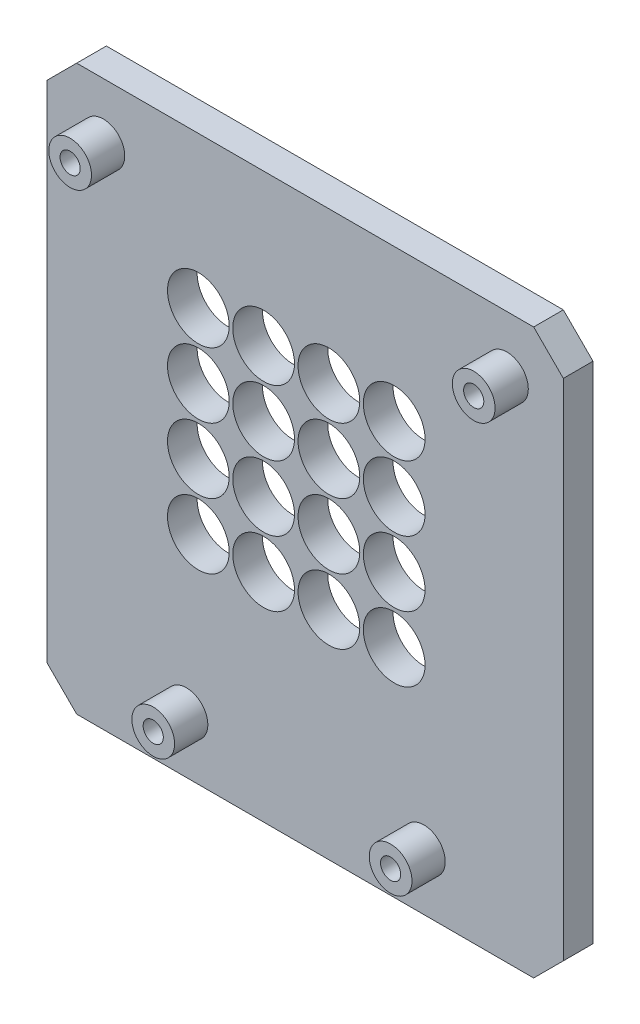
ISO-10303-21;
HEADER;
FILE_DESCRIPTION(('STEP AP214'),'2;1');
FILE_NAME('part.step','',(''),(''),'','','');
FILE_SCHEMA(('AUTOMOTIVE_DESIGN { 1 0 10303 214 1 1 1 1 }'));
ENDSEC;
DATA;
#1=APPLICATION_CONTEXT('core data for automotive mechanical design processes');
#2=APPLICATION_PROTOCOL_DEFINITION('international standard','automotive_design',2000,#1);
#3=PRODUCT_CONTEXT('',#1,'mechanical');
#4=PRODUCT('Part','Part','',(#3));
#5=PRODUCT_RELATED_PRODUCT_CATEGORY('part','',(#4));
#6=PRODUCT_DEFINITION_FORMATION('','',#4);
#7=PRODUCT_DEFINITION_CONTEXT('part definition',#1,'design');
#8=PRODUCT_DEFINITION('design','',#6,#7);
#9=PRODUCT_DEFINITION_SHAPE('','',#8);
#10=(LENGTH_UNIT() NAMED_UNIT(*) SI_UNIT(.MILLI.,.METRE.));
#11=(NAMED_UNIT(*) PLANE_ANGLE_UNIT() SI_UNIT($,.RADIAN.));
#12=(NAMED_UNIT(*) SI_UNIT($,.STERADIAN.) SOLID_ANGLE_UNIT());
#13=UNCERTAINTY_MEASURE_WITH_UNIT(LENGTH_MEASURE(1.E-05),#10,'distance_accuracy_value','');
#14=(GEOMETRIC_REPRESENTATION_CONTEXT(3) GLOBAL_UNCERTAINTY_ASSIGNED_CONTEXT((#13)) GLOBAL_UNIT_ASSIGNED_CONTEXT((#10,
#11,#12)) REPRESENTATION_CONTEXT('',''));
#15=CARTESIAN_POINT('',(0.,0.,0.));
#16=DIRECTION('',(0.,0.,1.));
#17=DIRECTION('',(1.,0.,0.));
#18=AXIS2_PLACEMENT_3D('',#15,#16,#17);
#19=CARTESIAN_POINT('',(0.,0.,5.));
#20=DIRECTION('',(0.,0.,1.));
#21=DIRECTION('',(1.,0.,0.));
#22=AXIS2_PLACEMENT_3D('',#19,#20,#21);
#23=PLANE('',#22);
#24=CARTESIAN_POINT('',(21.5,-43.5,5.));
#25=DIRECTION('',(0.,0.,1.));
#26=DIRECTION('',(1.,0.,0.));
#27=AXIS2_PLACEMENT_3D('',#24,#25,#26);
#28=CIRCLE('',#27,3.6);
#29=CARTESIAN_POINT('',(25.1,-43.5,5.));
#30=VERTEX_POINT('',#29);
#31=EDGE_CURVE('E319',#30,#30,#28,.T.);
#32=ORIENTED_EDGE('',*,*,#31,.F.);
#33=EDGE_LOOP('',(#32));
#34=FACE_BOUND('',#33,.T.);
#35=CARTESIAN_POINT('',(35.5,32.5,5.));
#36=DIRECTION('',(0.,0.,1.));
#37=DIRECTION('',(1.,0.,0.));
#38=AXIS2_PLACEMENT_3D('',#35,#36,#37);
#39=CIRCLE('',#38,3.6);
#40=CARTESIAN_POINT('',(39.1,32.5,5.));
#41=VERTEX_POINT('',#40);
#42=EDGE_CURVE('E312',#41,#41,#39,.T.);
#43=ORIENTED_EDGE('',*,*,#42,.F.);
#44=EDGE_LOOP('',(#43));
#45=FACE_BOUND('',#44,.T.);
#46=CARTESIAN_POINT('',(5.5,16.5,5.));
#47=DIRECTION('',(0.,0.,1.));
#48=DIRECTION('',(1.,0.,0.));
#49=AXIS2_PLACEMENT_3D('',#46,#47,#48);
#50=CIRCLE('',#49,5.2);
#51=CARTESIAN_POINT('',(10.7,16.5,5.));
#52=VERTEX_POINT('',#51);
#53=EDGE_CURVE('E270',#52,#52,#50,.T.);
#54=ORIENTED_EDGE('',*,*,#53,.F.);
#55=EDGE_LOOP('',(#54));
#56=FACE_BOUND('',#55,.T.);
#57=CARTESIAN_POINT('',(-16.5,16.5,5.));
#58=DIRECTION('',(0.,0.,1.));
#59=DIRECTION('',(1.,0.,0.));
#60=AXIS2_PLACEMENT_3D('',#57,#58,#59);
#61=CIRCLE('',#60,5.2);
#62=CARTESIAN_POINT('',(-11.3,16.5,5.));
#63=VERTEX_POINT('',#62);
#64=EDGE_CURVE('E258',#63,#63,#61,.T.);
#65=ORIENTED_EDGE('',*,*,#64,.F.);
#66=EDGE_LOOP('',(#65));
#67=FACE_BOUND('',#66,.T.);
#68=CARTESIAN_POINT('',(5.5,5.5,5.));
#69=DIRECTION('',(0.,0.,1.));
#70=DIRECTION('',(1.,0.,0.));
#71=AXIS2_PLACEMENT_3D('',#68,#69,#70);
#72=CIRCLE('',#71,5.2);
#73=CARTESIAN_POINT('',(10.7,5.5,5.));
#74=VERTEX_POINT('',#73);
#75=EDGE_CURVE('E246',#74,#74,#72,.T.);
#76=ORIENTED_EDGE('',*,*,#75,.F.);
#77=EDGE_LOOP('',(#76));
#78=FACE_BOUND('',#77,.T.);
#79=CARTESIAN_POINT('',(-16.5,5.5,5.));
#80=DIRECTION('',(0.,0.,1.));
#81=DIRECTION('',(1.,0.,0.));
#82=AXIS2_PLACEMENT_3D('',#79,#80,#81);
#83=CIRCLE('',#82,5.2);
#84=CARTESIAN_POINT('',(-11.3,5.5,5.));
#85=VERTEX_POINT('',#84);
#86=EDGE_CURVE('E234',#85,#85,#83,.T.);
#87=ORIENTED_EDGE('',*,*,#86,.F.);
#88=EDGE_LOOP('',(#87));
#89=FACE_BOUND('',#88,.T.);
#90=CARTESIAN_POINT('',(5.5,-5.5,5.));
#91=DIRECTION('',(0.,0.,1.));
#92=DIRECTION('',(1.,0.,0.));
#93=AXIS2_PLACEMENT_3D('',#90,#91,#92);
#94=CIRCLE('',#93,5.2);
#95=CARTESIAN_POINT('',(10.7,-5.5,5.));
#96=VERTEX_POINT('',#95);
#97=EDGE_CURVE('E222',#96,#96,#94,.T.);
#98=ORIENTED_EDGE('',*,*,#97,.F.);
#99=EDGE_LOOP('',(#98));
#100=FACE_BOUND('',#99,.T.);
#101=CARTESIAN_POINT('',(-16.5,-5.5,5.));
#102=DIRECTION('',(0.,0.,1.));
#103=DIRECTION('',(1.,0.,0.));
#104=AXIS2_PLACEMENT_3D('',#101,#102,#103);
#105=CIRCLE('',#104,5.2);
#106=CARTESIAN_POINT('',(-11.3,-5.5,5.));
#107=VERTEX_POINT('',#106);
#108=EDGE_CURVE('E210',#107,#107,#105,.T.);
#109=ORIENTED_EDGE('',*,*,#108,.F.);
#110=EDGE_LOOP('',(#109));
#111=FACE_BOUND('',#110,.T.);
#112=CARTESIAN_POINT('',(5.5,-16.5,5.));
#113=DIRECTION('',(0.,0.,1.));
#114=DIRECTION('',(1.,0.,0.));
#115=AXIS2_PLACEMENT_3D('',#112,#113,#114);
#116=CIRCLE('',#115,5.2);
#117=CARTESIAN_POINT('',(10.7,-16.5,5.));
#118=VERTEX_POINT('',#117);
#119=EDGE_CURVE('E198',#118,#118,#116,.T.);
#120=ORIENTED_EDGE('',*,*,#119,.F.);
#121=EDGE_LOOP('',(#120));
#122=FACE_BOUND('',#121,.T.);
#123=CARTESIAN_POINT('',(-16.5,-16.5,5.));
#124=DIRECTION('',(0.,0.,1.));
#125=DIRECTION('',(1.,0.,0.));
#126=AXIS2_PLACEMENT_3D('',#123,#124,#125);
#127=CIRCLE('',#126,5.2);
#128=CARTESIAN_POINT('',(-11.3,-16.5,5.));
#129=VERTEX_POINT('',#128);
#130=EDGE_CURVE('E144',#129,#129,#127,.T.);
#131=ORIENTED_EDGE('',*,*,#130,.F.);
#132=EDGE_LOOP('',(#131));
#133=FACE_BOUND('',#132,.T.);
#134=DIRECTION('',(0.707106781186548,-0.707106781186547,0.));
#135=VECTOR('',#134,1.);
#136=CARTESIAN_POINT('',(-42.,-48.,5.));
#137=LINE('',#136,#135);
#138=CARTESIAN_POINT('',(-42.,-48.,5.));
#139=VERTEX_POINT('',#138);
#140=CARTESIAN_POINT('',(-37.,-53.,5.));
#141=VERTEX_POINT('',#140);
#142=EDGE_CURVE('E155',#139,#141,#137,.T.);
#143=ORIENTED_EDGE('',*,*,#142,.T.);
#144=DIRECTION('',(1.,0.,0.));
#145=VECTOR('',#144,1.);
#146=CARTESIAN_POINT('',(-37.,-53.,5.));
#147=LINE('',#146,#145);
#148=CARTESIAN_POINT('',(40.,-53.,5.));
#149=VERTEX_POINT('',#148);
#150=EDGE_CURVE('E103',#141,#149,#147,.T.);
#151=ORIENTED_EDGE('',*,*,#150,.T.);
#152=DIRECTION('',(0.707106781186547,0.707106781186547,0.));
#153=VECTOR('',#152,1.);
#154=CARTESIAN_POINT('',(40.,-53.,5.));
#155=LINE('',#154,#153);
#156=CARTESIAN_POINT('',(45.,-48.,5.));
#157=VERTEX_POINT('',#156);
#158=EDGE_CURVE('E170',#149,#157,#155,.T.);
#159=ORIENTED_EDGE('',*,*,#158,.T.);
#160=DIRECTION('',(0.,1.,0.));
#161=VECTOR('',#160,1.);
#162=CARTESIAN_POINT('',(45.,-48.,5.));
#163=LINE('',#162,#161);
#164=CARTESIAN_POINT('',(45.,37.,5.));
#165=VERTEX_POINT('',#164);
#166=EDGE_CURVE('E183',#157,#165,#163,.T.);
#167=ORIENTED_EDGE('',*,*,#166,.T.);
#168=DIRECTION('',(-0.707106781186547,0.707106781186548,0.));
#169=VECTOR('',#168,1.);
#170=CARTESIAN_POINT('',(45.,37.,5.));
#171=LINE('',#170,#169);
#172=CARTESIAN_POINT('',(40.,42.,5.));
#173=VERTEX_POINT('',#172);
#174=EDGE_CURVE('E122',#165,#173,#171,.T.);
#175=ORIENTED_EDGE('',*,*,#174,.T.);
#176=DIRECTION('',(-1.,0.,0.));
#177=VECTOR('',#176,1.);
#178=CARTESIAN_POINT('',(40.,42.,5.));
#179=LINE('',#178,#177);
#180=CARTESIAN_POINT('',(-37.,42.,5.));
#181=VERTEX_POINT('',#180);
#182=EDGE_CURVE('E116',#173,#181,#179,.T.);
#183=ORIENTED_EDGE('',*,*,#182,.T.);
#184=DIRECTION('',(-0.707106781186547,-0.707106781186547,0.));
#185=VECTOR('',#184,1.);
#186=CARTESIAN_POINT('',(-37.,42.,5.));
#187=LINE('',#186,#185);
#188=CARTESIAN_POINT('',(-42.,37.,5.));
#189=VERTEX_POINT('',#188);
#190=EDGE_CURVE('E120',#181,#189,#187,.T.);
#191=ORIENTED_EDGE('',*,*,#190,.T.);
#192=DIRECTION('',(0.,-1.,0.));
#193=VECTOR('',#192,1.);
#194=CARTESIAN_POINT('',(-42.,37.,5.));
#195=LINE('',#194,#193);
#196=EDGE_CURVE('E60',#189,#139,#195,.T.);
#197=ORIENTED_EDGE('',*,*,#196,.T.);
#198=EDGE_LOOP('',(#143,#151,#159,#167,#175,#183,#191,#197));
#199=FACE_BOUND('',#198,.T.);
#200=CARTESIAN_POINT('',(-5.5,-16.5,5.));
#201=DIRECTION('',(0.,0.,1.));
#202=DIRECTION('',(1.,0.,0.));
#203=AXIS2_PLACEMENT_3D('',#200,#201,#202);
#204=CIRCLE('',#203,5.2);
#205=CARTESIAN_POINT('',(-0.3,-16.5,5.));
#206=VERTEX_POINT('',#205);
#207=EDGE_CURVE('E192',#206,#206,#204,.T.);
#208=ORIENTED_EDGE('',*,*,#207,.F.);
#209=EDGE_LOOP('',(#208));
#210=FACE_BOUND('',#209,.T.);
#211=CARTESIAN_POINT('',(16.5,-16.5,5.));
#212=DIRECTION('',(0.,0.,1.));
#213=DIRECTION('',(1.,0.,0.));
#214=AXIS2_PLACEMENT_3D('',#211,#212,#213);
#215=CIRCLE('',#214,5.2);
#216=CARTESIAN_POINT('',(21.7,-16.5,5.));
#217=VERTEX_POINT('',#216);
#218=EDGE_CURVE('E204',#217,#217,#215,.T.);
#219=ORIENTED_EDGE('',*,*,#218,.F.);
#220=EDGE_LOOP('',(#219));
#221=FACE_BOUND('',#220,.T.);
#222=CARTESIAN_POINT('',(-5.5,-5.5,5.));
#223=DIRECTION('',(0.,0.,1.));
#224=DIRECTION('',(1.,0.,0.));
#225=AXIS2_PLACEMENT_3D('',#222,#223,#224);
#226=CIRCLE('',#225,5.2);
#227=CARTESIAN_POINT('',(-0.3,-5.5,5.));
#228=VERTEX_POINT('',#227);
#229=EDGE_CURVE('E216',#228,#228,#226,.T.);
#230=ORIENTED_EDGE('',*,*,#229,.F.);
#231=EDGE_LOOP('',(#230));
#232=FACE_BOUND('',#231,.T.);
#233=CARTESIAN_POINT('',(16.5,-5.5,5.));
#234=DIRECTION('',(0.,0.,1.));
#235=DIRECTION('',(1.,0.,0.));
#236=AXIS2_PLACEMENT_3D('',#233,#234,#235);
#237=CIRCLE('',#236,5.2);
#238=CARTESIAN_POINT('',(21.7,-5.5,5.));
#239=VERTEX_POINT('',#238);
#240=EDGE_CURVE('E228',#239,#239,#237,.T.);
#241=ORIENTED_EDGE('',*,*,#240,.F.);
#242=EDGE_LOOP('',(#241));
#243=FACE_BOUND('',#242,.T.);
#244=CARTESIAN_POINT('',(-5.5,5.5,5.));
#245=DIRECTION('',(0.,0.,1.));
#246=DIRECTION('',(1.,0.,0.));
#247=AXIS2_PLACEMENT_3D('',#244,#245,#246);
#248=CIRCLE('',#247,5.2);
#249=CARTESIAN_POINT('',(-0.3,5.5,5.));
#250=VERTEX_POINT('',#249);
#251=EDGE_CURVE('E240',#250,#250,#248,.T.);
#252=ORIENTED_EDGE('',*,*,#251,.F.);
#253=EDGE_LOOP('',(#252));
#254=FACE_BOUND('',#253,.T.);
#255=CARTESIAN_POINT('',(16.5,5.5,5.));
#256=DIRECTION('',(0.,0.,1.));
#257=DIRECTION('',(1.,0.,0.));
#258=AXIS2_PLACEMENT_3D('',#255,#256,#257);
#259=CIRCLE('',#258,5.2);
#260=CARTESIAN_POINT('',(21.7,5.5,5.));
#261=VERTEX_POINT('',#260);
#262=EDGE_CURVE('E252',#261,#261,#259,.T.);
#263=ORIENTED_EDGE('',*,*,#262,.F.);
#264=EDGE_LOOP('',(#263));
#265=FACE_BOUND('',#264,.T.);
#266=CARTESIAN_POINT('',(-5.5,16.5,5.));
#267=DIRECTION('',(0.,0.,1.));
#268=DIRECTION('',(1.,0.,0.));
#269=AXIS2_PLACEMENT_3D('',#266,#267,#268);
#270=CIRCLE('',#269,5.2);
#271=CARTESIAN_POINT('',(-0.3,16.5,5.));
#272=VERTEX_POINT('',#271);
#273=EDGE_CURVE('E264',#272,#272,#270,.T.);
#274=ORIENTED_EDGE('',*,*,#273,.F.);
#275=EDGE_LOOP('',(#274));
#276=FACE_BOUND('',#275,.T.);
#277=CARTESIAN_POINT('',(16.5,16.5,5.));
#278=DIRECTION('',(0.,0.,1.));
#279=DIRECTION('',(1.,0.,0.));
#280=AXIS2_PLACEMENT_3D('',#277,#278,#279);
#281=CIRCLE('',#280,5.2);
#282=CARTESIAN_POINT('',(21.7,16.5,5.));
#283=VERTEX_POINT('',#282);
#284=EDGE_CURVE('E276',#283,#283,#281,.T.);
#285=ORIENTED_EDGE('',*,*,#284,.F.);
#286=EDGE_LOOP('',(#285));
#287=FACE_BOUND('',#286,.T.);
#288=CARTESIAN_POINT('',(-18.5,-43.5,5.));
#289=DIRECTION('',(0.,0.,1.));
#290=DIRECTION('',(1.,0.,0.));
#291=AXIS2_PLACEMENT_3D('',#288,#289,#290);
#292=CIRCLE('',#291,3.6);
#293=CARTESIAN_POINT('',(-14.9,-43.5,5.));
#294=VERTEX_POINT('',#293);
#295=EDGE_CURVE('E301',#294,#294,#292,.T.);
#296=ORIENTED_EDGE('',*,*,#295,.F.);
#297=EDGE_LOOP('',(#296));
#298=FACE_BOUND('',#297,.T.);
#299=CARTESIAN_POINT('',(-32.5,32.5,5.));
#300=DIRECTION('',(0.,0.,1.));
#301=DIRECTION('',(1.,0.,0.));
#302=AXIS2_PLACEMENT_3D('',#299,#300,#301);
#303=CIRCLE('',#302,3.6);
#304=CARTESIAN_POINT('',(-28.9,32.5,5.));
#305=VERTEX_POINT('',#304);
#306=EDGE_CURVE('E325',#305,#305,#303,.T.);
#307=ORIENTED_EDGE('',*,*,#306,.F.);
#308=EDGE_LOOP('',(#307));
#309=FACE_BOUND('',#308,.T.);
#310=ADVANCED_FACE('F43',(#34,#45,#56,#67,#78,#89,#100,#111,#122,#133,#199,#210,#221,#232,#243,
#254,#265,#276,#287,#298,#309),#23,.T.);
#311=CARTESIAN_POINT('',(0.,0.,0.));
#312=DIRECTION('',(0.,0.,1.));
#313=DIRECTION('',(1.,0.,0.));
#314=AXIS2_PLACEMENT_3D('',#311,#312,#313);
#315=PLANE('',#314);
#316=DIRECTION('',(0.707106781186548,-0.707106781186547,0.));
#317=VECTOR('',#316,1.);
#318=CARTESIAN_POINT('',(-42.,-48.,0.));
#319=LINE('',#318,#317);
#320=CARTESIAN_POINT('',(-42.,-48.,0.));
#321=VERTEX_POINT('',#320);
#322=CARTESIAN_POINT('',(-37.,-53.,0.));
#323=VERTEX_POINT('',#322);
#324=EDGE_CURVE('E140',#321,#323,#319,.T.);
#325=ORIENTED_EDGE('',*,*,#324,.F.);
#326=DIRECTION('',(0.,-1.,0.));
#327=VECTOR('',#326,1.);
#328=CARTESIAN_POINT('',(-42.,37.,0.));
#329=LINE('',#328,#327);
#330=CARTESIAN_POINT('',(-42.,37.,0.));
#331=VERTEX_POINT('',#330);
#332=EDGE_CURVE('E95',#331,#321,#329,.T.);
#333=ORIENTED_EDGE('',*,*,#332,.F.);
#334=DIRECTION('',(-0.707106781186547,-0.707106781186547,0.));
#335=VECTOR('',#334,1.);
#336=CARTESIAN_POINT('',(-37.,42.,0.));
#337=LINE('',#336,#335);
#338=CARTESIAN_POINT('',(-37.,42.,0.));
#339=VERTEX_POINT('',#338);
#340=EDGE_CURVE('E89',#339,#331,#337,.T.);
#341=ORIENTED_EDGE('',*,*,#340,.F.);
#342=DIRECTION('',(-1.,0.,0.));
#343=VECTOR('',#342,1.);
#344=CARTESIAN_POINT('',(40.,42.,0.));
#345=LINE('',#344,#343);
#346=CARTESIAN_POINT('',(40.,42.,0.));
#347=VERTEX_POINT('',#346);
#348=EDGE_CURVE('E130',#347,#339,#345,.T.);
#349=ORIENTED_EDGE('',*,*,#348,.F.);
#350=DIRECTION('',(-0.707106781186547,0.707106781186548,0.));
#351=VECTOR('',#350,1.);
#352=CARTESIAN_POINT('',(45.,37.,0.));
#353=LINE('',#352,#351);
#354=CARTESIAN_POINT('',(45.,37.,0.));
#355=VERTEX_POINT('',#354);
#356=EDGE_CURVE('E150',#355,#347,#353,.T.);
#357=ORIENTED_EDGE('',*,*,#356,.F.);
#358=DIRECTION('',(0.,1.,0.));
#359=VECTOR('',#358,1.);
#360=CARTESIAN_POINT('',(45.,-48.,0.));
#361=LINE('',#360,#359);
#362=CARTESIAN_POINT('',(45.,-48.,0.));
#363=VERTEX_POINT('',#362);
#364=EDGE_CURVE('E148',#363,#355,#361,.T.);
#365=ORIENTED_EDGE('',*,*,#364,.F.);
#366=DIRECTION('',(0.707106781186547,0.707106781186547,0.));
#367=VECTOR('',#366,1.);
#368=CARTESIAN_POINT('',(40.,-53.,0.));
#369=LINE('',#368,#367);
#370=CARTESIAN_POINT('',(40.,-53.,0.));
#371=VERTEX_POINT('',#370);
#372=EDGE_CURVE('E146',#371,#363,#369,.T.);
#373=ORIENTED_EDGE('',*,*,#372,.F.);
#374=DIRECTION('',(1.,0.,0.));
#375=VECTOR('',#374,1.);
#376=CARTESIAN_POINT('',(-37.,-53.,0.));
#377=LINE('',#376,#375);
#378=EDGE_CURVE('E143',#323,#371,#377,.T.);
#379=ORIENTED_EDGE('',*,*,#378,.F.);
#380=EDGE_LOOP('',(#325,#333,#341,#349,#357,#365,#373,#379));
#381=FACE_BOUND('',#380,.T.);
#382=CARTESIAN_POINT('',(-16.5,-16.5,0.));
#383=DIRECTION('',(0.,0.,1.));
#384=DIRECTION('',(1.,0.,0.));
#385=AXIS2_PLACEMENT_3D('',#382,#383,#384);
#386=CIRCLE('',#385,5.2);
#387=CARTESIAN_POINT('',(-11.3,-16.5,0.));
#388=VERTEX_POINT('',#387);
#389=EDGE_CURVE('E189',#388,#388,#386,.T.);
#390=ORIENTED_EDGE('',*,*,#389,.T.);
#391=EDGE_LOOP('',(#390));
#392=FACE_BOUND('',#391,.T.);
#393=CARTESIAN_POINT('',(-5.5,-16.5,0.));
#394=DIRECTION('',(0.,0.,1.));
#395=DIRECTION('',(1.,0.,0.));
#396=AXIS2_PLACEMENT_3D('',#393,#394,#395);
#397=CIRCLE('',#396,5.2);
#398=CARTESIAN_POINT('',(-0.3,-16.5,0.));
#399=VERTEX_POINT('',#398);
#400=EDGE_CURVE('E195',#399,#399,#397,.T.);
#401=ORIENTED_EDGE('',*,*,#400,.T.);
#402=EDGE_LOOP('',(#401));
#403=FACE_BOUND('',#402,.T.);
#404=CARTESIAN_POINT('',(5.5,-16.5,0.));
#405=DIRECTION('',(0.,0.,1.));
#406=DIRECTION('',(1.,0.,0.));
#407=AXIS2_PLACEMENT_3D('',#404,#405,#406);
#408=CIRCLE('',#407,5.2);
#409=CARTESIAN_POINT('',(10.7,-16.5,0.));
#410=VERTEX_POINT('',#409);
#411=EDGE_CURVE('E201',#410,#410,#408,.T.);
#412=ORIENTED_EDGE('',*,*,#411,.T.);
#413=EDGE_LOOP('',(#412));
#414=FACE_BOUND('',#413,.T.);
#415=CARTESIAN_POINT('',(16.5,-16.5,0.));
#416=DIRECTION('',(0.,0.,1.));
#417=DIRECTION('',(1.,0.,0.));
#418=AXIS2_PLACEMENT_3D('',#415,#416,#417);
#419=CIRCLE('',#418,5.2);
#420=CARTESIAN_POINT('',(21.7,-16.5,0.));
#421=VERTEX_POINT('',#420);
#422=EDGE_CURVE('E207',#421,#421,#419,.T.);
#423=ORIENTED_EDGE('',*,*,#422,.T.);
#424=EDGE_LOOP('',(#423));
#425=FACE_BOUND('',#424,.T.);
#426=CARTESIAN_POINT('',(-16.5,-5.5,0.));
#427=DIRECTION('',(0.,0.,1.));
#428=DIRECTION('',(1.,0.,0.));
#429=AXIS2_PLACEMENT_3D('',#426,#427,#428);
#430=CIRCLE('',#429,5.2);
#431=CARTESIAN_POINT('',(-11.3,-5.5,0.));
#432=VERTEX_POINT('',#431);
#433=EDGE_CURVE('E213',#432,#432,#430,.T.);
#434=ORIENTED_EDGE('',*,*,#433,.T.);
#435=EDGE_LOOP('',(#434));
#436=FACE_BOUND('',#435,.T.);
#437=CARTESIAN_POINT('',(-5.5,-5.5,0.));
#438=DIRECTION('',(0.,0.,1.));
#439=DIRECTION('',(1.,0.,0.));
#440=AXIS2_PLACEMENT_3D('',#437,#438,#439);
#441=CIRCLE('',#440,5.2);
#442=CARTESIAN_POINT('',(-0.3,-5.5,0.));
#443=VERTEX_POINT('',#442);
#444=EDGE_CURVE('E219',#443,#443,#441,.T.);
#445=ORIENTED_EDGE('',*,*,#444,.T.);
#446=EDGE_LOOP('',(#445));
#447=FACE_BOUND('',#446,.T.);
#448=CARTESIAN_POINT('',(5.5,-5.5,0.));
#449=DIRECTION('',(0.,0.,1.));
#450=DIRECTION('',(1.,0.,0.));
#451=AXIS2_PLACEMENT_3D('',#448,#449,#450);
#452=CIRCLE('',#451,5.2);
#453=CARTESIAN_POINT('',(10.7,-5.5,0.));
#454=VERTEX_POINT('',#453);
#455=EDGE_CURVE('E225',#454,#454,#452,.T.);
#456=ORIENTED_EDGE('',*,*,#455,.T.);
#457=EDGE_LOOP('',(#456));
#458=FACE_BOUND('',#457,.T.);
#459=CARTESIAN_POINT('',(16.5,-5.5,0.));
#460=DIRECTION('',(0.,0.,1.));
#461=DIRECTION('',(1.,0.,0.));
#462=AXIS2_PLACEMENT_3D('',#459,#460,#461);
#463=CIRCLE('',#462,5.2);
#464=CARTESIAN_POINT('',(21.7,-5.5,0.));
#465=VERTEX_POINT('',#464);
#466=EDGE_CURVE('E231',#465,#465,#463,.T.);
#467=ORIENTED_EDGE('',*,*,#466,.T.);
#468=EDGE_LOOP('',(#467));
#469=FACE_BOUND('',#468,.T.);
#470=CARTESIAN_POINT('',(-16.5,5.5,0.));
#471=DIRECTION('',(0.,0.,1.));
#472=DIRECTION('',(1.,0.,0.));
#473=AXIS2_PLACEMENT_3D('',#470,#471,#472);
#474=CIRCLE('',#473,5.2);
#475=CARTESIAN_POINT('',(-11.3,5.5,0.));
#476=VERTEX_POINT('',#475);
#477=EDGE_CURVE('E237',#476,#476,#474,.T.);
#478=ORIENTED_EDGE('',*,*,#477,.T.);
#479=EDGE_LOOP('',(#478));
#480=FACE_BOUND('',#479,.T.);
#481=CARTESIAN_POINT('',(-5.5,5.5,0.));
#482=DIRECTION('',(0.,0.,1.));
#483=DIRECTION('',(1.,0.,0.));
#484=AXIS2_PLACEMENT_3D('',#481,#482,#483);
#485=CIRCLE('',#484,5.2);
#486=CARTESIAN_POINT('',(-0.3,5.5,0.));
#487=VERTEX_POINT('',#486);
#488=EDGE_CURVE('E243',#487,#487,#485,.T.);
#489=ORIENTED_EDGE('',*,*,#488,.T.);
#490=EDGE_LOOP('',(#489));
#491=FACE_BOUND('',#490,.T.);
#492=CARTESIAN_POINT('',(5.5,5.5,0.));
#493=DIRECTION('',(0.,0.,1.));
#494=DIRECTION('',(1.,0.,0.));
#495=AXIS2_PLACEMENT_3D('',#492,#493,#494);
#496=CIRCLE('',#495,5.2);
#497=CARTESIAN_POINT('',(10.7,5.5,0.));
#498=VERTEX_POINT('',#497);
#499=EDGE_CURVE('E249',#498,#498,#496,.T.);
#500=ORIENTED_EDGE('',*,*,#499,.T.);
#501=EDGE_LOOP('',(#500));
#502=FACE_BOUND('',#501,.T.);
#503=CARTESIAN_POINT('',(16.5,5.5,0.));
#504=DIRECTION('',(0.,0.,1.));
#505=DIRECTION('',(1.,0.,0.));
#506=AXIS2_PLACEMENT_3D('',#503,#504,#505);
#507=CIRCLE('',#506,5.2);
#508=CARTESIAN_POINT('',(21.7,5.5,0.));
#509=VERTEX_POINT('',#508);
#510=EDGE_CURVE('E255',#509,#509,#507,.T.);
#511=ORIENTED_EDGE('',*,*,#510,.T.);
#512=EDGE_LOOP('',(#511));
#513=FACE_BOUND('',#512,.T.);
#514=CARTESIAN_POINT('',(-16.5,16.5,0.));
#515=DIRECTION('',(0.,0.,1.));
#516=DIRECTION('',(1.,0.,0.));
#517=AXIS2_PLACEMENT_3D('',#514,#515,#516);
#518=CIRCLE('',#517,5.2);
#519=CARTESIAN_POINT('',(-11.3,16.5,0.));
#520=VERTEX_POINT('',#519);
#521=EDGE_CURVE('E261',#520,#520,#518,.T.);
#522=ORIENTED_EDGE('',*,*,#521,.T.);
#523=EDGE_LOOP('',(#522));
#524=FACE_BOUND('',#523,.T.);
#525=CARTESIAN_POINT('',(-5.5,16.5,0.));
#526=DIRECTION('',(0.,0.,1.));
#527=DIRECTION('',(1.,0.,0.));
#528=AXIS2_PLACEMENT_3D('',#525,#526,#527);
#529=CIRCLE('',#528,5.2);
#530=CARTESIAN_POINT('',(-0.3,16.5,0.));
#531=VERTEX_POINT('',#530);
#532=EDGE_CURVE('E267',#531,#531,#529,.T.);
#533=ORIENTED_EDGE('',*,*,#532,.T.);
#534=EDGE_LOOP('',(#533));
#535=FACE_BOUND('',#534,.T.);
#536=CARTESIAN_POINT('',(5.5,16.5,0.));
#537=DIRECTION('',(0.,0.,1.));
#538=DIRECTION('',(1.,0.,0.));
#539=AXIS2_PLACEMENT_3D('',#536,#537,#538);
#540=CIRCLE('',#539,5.2);
#541=CARTESIAN_POINT('',(10.7,16.5,0.));
#542=VERTEX_POINT('',#541);
#543=EDGE_CURVE('E273',#542,#542,#540,.T.);
#544=ORIENTED_EDGE('',*,*,#543,.T.);
#545=EDGE_LOOP('',(#544));
#546=FACE_BOUND('',#545,.T.);
#547=CARTESIAN_POINT('',(16.5,16.5,0.));
#548=DIRECTION('',(0.,0.,1.));
#549=DIRECTION('',(1.,0.,0.));
#550=AXIS2_PLACEMENT_3D('',#547,#548,#549);
#551=CIRCLE('',#550,5.2);
#552=CARTESIAN_POINT('',(21.7,16.5,0.));
#553=VERTEX_POINT('',#552);
#554=EDGE_CURVE('E279',#553,#553,#551,.T.);
#555=ORIENTED_EDGE('',*,*,#554,.T.);
#556=EDGE_LOOP('',(#555));
#557=FACE_BOUND('',#556,.T.);
#558=CARTESIAN_POINT('',(-32.5,32.5,0.));
#559=DIRECTION('',(0.,0.,1.));
#560=DIRECTION('',(1.,0.,0.));
#561=AXIS2_PLACEMENT_3D('',#558,#559,#560);
#562=CIRCLE('',#561,1.7);
#563=CARTESIAN_POINT('',(-30.8,32.5,0.));
#564=VERTEX_POINT('',#563);
#565=EDGE_CURVE('E282',#564,#564,#562,.T.);
#566=ORIENTED_EDGE('',*,*,#565,.T.);
#567=EDGE_LOOP('',(#566));
#568=FACE_BOUND('',#567,.T.);
#569=CARTESIAN_POINT('',(35.5,32.5,0.));
#570=DIRECTION('',(0.,0.,1.));
#571=DIRECTION('',(1.,0.,0.));
#572=AXIS2_PLACEMENT_3D('',#569,#570,#571);
#573=CIRCLE('',#572,1.7);
#574=CARTESIAN_POINT('',(37.2,32.5,0.));
#575=VERTEX_POINT('',#574);
#576=EDGE_CURVE('E287',#575,#575,#573,.T.);
#577=ORIENTED_EDGE('',*,*,#576,.T.);
#578=EDGE_LOOP('',(#577));
#579=FACE_BOUND('',#578,.T.);
#580=CARTESIAN_POINT('',(-18.5,-43.5,0.));
#581=DIRECTION('',(0.,0.,1.));
#582=DIRECTION('',(1.,0.,0.));
#583=AXIS2_PLACEMENT_3D('',#580,#581,#582);
#584=CIRCLE('',#583,1.7);
#585=CARTESIAN_POINT('',(-16.8,-43.5,0.));
#586=VERTEX_POINT('',#585);
#587=EDGE_CURVE('E290',#586,#586,#584,.T.);
#588=ORIENTED_EDGE('',*,*,#587,.T.);
#589=EDGE_LOOP('',(#588));
#590=FACE_BOUND('',#589,.T.);
#591=CARTESIAN_POINT('',(21.5,-43.5,0.));
#592=DIRECTION('',(0.,0.,1.));
#593=DIRECTION('',(1.,0.,0.));
#594=AXIS2_PLACEMENT_3D('',#591,#592,#593);
#595=CIRCLE('',#594,1.7);
#596=CARTESIAN_POINT('',(23.2,-43.5,0.));
#597=VERTEX_POINT('',#596);
#598=EDGE_CURVE('E293',#597,#597,#595,.T.);
#599=ORIENTED_EDGE('',*,*,#598,.T.);
#600=EDGE_LOOP('',(#599));
#601=FACE_BOUND('',#600,.T.);
#602=ADVANCED_FACE('F174',(#381,#392,#403,#414,#425,#436,#447,#458,#469,#480,#491,#502,#513,
#524,#535,#546,#557,#568,#579,#590,#601),#315,.F.);
#603=CARTESIAN_POINT('',(-42.,-48.,5.));
#604=DIRECTION('',(0.707106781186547,0.707106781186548,0.));
#605=DIRECTION('',(-0.707106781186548,0.707106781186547,0.));
#606=AXIS2_PLACEMENT_3D('',#603,#604,#605);
#607=PLANE('',#606);
#608=ORIENTED_EDGE('',*,*,#324,.T.);
#609=DIRECTION('',(0.,0.,-1.));
#610=VECTOR('',#609,1.);
#611=CARTESIAN_POINT('',(-37.,-53.,5.));
#612=LINE('',#611,#610);
#613=EDGE_CURVE('E11',#141,#323,#612,.T.);
#614=ORIENTED_EDGE('',*,*,#613,.F.);
#615=ORIENTED_EDGE('',*,*,#142,.F.);
#616=DIRECTION('',(0.,0.,-1.));
#617=VECTOR('',#616,1.);
#618=CARTESIAN_POINT('',(-42.,-48.,5.));
#619=LINE('',#618,#617);
#620=EDGE_CURVE('E136',#139,#321,#619,.T.);
#621=ORIENTED_EDGE('',*,*,#620,.T.);
#622=EDGE_LOOP('',(#608,#614,#615,#621));
#623=FACE_BOUND('',#622,.T.);
#624=ADVANCED_FACE('F45',(#623),#607,.F.);
#625=CARTESIAN_POINT('',(-37.,-53.,5.));
#626=DIRECTION('',(0.,1.,0.));
#627=DIRECTION('',(0.,0.,1.));
#628=AXIS2_PLACEMENT_3D('',#625,#626,#627);
#629=PLANE('',#628);
#630=ORIENTED_EDGE('',*,*,#378,.T.);
#631=DIRECTION('',(0.,0.,-1.));
#632=VECTOR('',#631,1.);
#633=CARTESIAN_POINT('',(40.,-53.,5.));
#634=LINE('',#633,#632);
#635=EDGE_CURVE('E52',#149,#371,#634,.T.);
#636=ORIENTED_EDGE('',*,*,#635,.F.);
#637=ORIENTED_EDGE('',*,*,#150,.F.);
#638=ORIENTED_EDGE('',*,*,#613,.T.);
#639=EDGE_LOOP('',(#630,#636,#637,#638));
#640=FACE_BOUND('',#639,.T.);
#641=ADVANCED_FACE('F377',(#640),#629,.F.);
#642=CARTESIAN_POINT('',(40.,-53.,5.));
#643=DIRECTION('',(-0.707106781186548,0.707106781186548,0.));
#644=DIRECTION('',(-0.707106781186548,-0.707106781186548,0.));
#645=AXIS2_PLACEMENT_3D('',#642,#643,#644);
#646=PLANE('',#645);
#647=ORIENTED_EDGE('',*,*,#372,.T.);
#648=DIRECTION('',(0.,0.,-1.));
#649=VECTOR('',#648,1.);
#650=CARTESIAN_POINT('',(45.,-48.,5.));
#651=LINE('',#650,#649);
#652=EDGE_CURVE('E162',#157,#363,#651,.T.);
#653=ORIENTED_EDGE('',*,*,#652,.F.);
#654=ORIENTED_EDGE('',*,*,#158,.F.);
#655=ORIENTED_EDGE('',*,*,#635,.T.);
#656=EDGE_LOOP('',(#647,#653,#654,#655));
#657=FACE_BOUND('',#656,.T.);
#658=ADVANCED_FACE('F168',(#657),#646,.F.);
#659=CARTESIAN_POINT('',(45.,-48.,5.));
#660=DIRECTION('',(-1.,0.,0.));
#661=DIRECTION('',(0.,0.,1.));
#662=AXIS2_PLACEMENT_3D('',#659,#660,#661);
#663=PLANE('',#662);
#664=ORIENTED_EDGE('',*,*,#364,.T.);
#665=DIRECTION('',(0.,0.,-1.));
#666=VECTOR('',#665,1.);
#667=CARTESIAN_POINT('',(45.,37.,5.));
#668=LINE('',#667,#666);
#669=EDGE_CURVE('E159',#165,#355,#668,.T.);
#670=ORIENTED_EDGE('',*,*,#669,.F.);
#671=ORIENTED_EDGE('',*,*,#166,.F.);
#672=ORIENTED_EDGE('',*,*,#652,.T.);
#673=EDGE_LOOP('',(#664,#670,#671,#672));
#674=FACE_BOUND('',#673,.T.);
#675=ADVANCED_FACE('F179',(#674),#663,.F.);
#676=CARTESIAN_POINT('',(45.,37.,5.));
#677=DIRECTION('',(-0.707106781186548,-0.707106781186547,0.));
#678=DIRECTION('',(0.707106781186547,-0.707106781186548,0.));
#679=AXIS2_PLACEMENT_3D('',#676,#677,#678);
#680=PLANE('',#679);
#681=ORIENTED_EDGE('',*,*,#356,.T.);
#682=DIRECTION('',(0.,0.,-1.));
#683=VECTOR('',#682,1.);
#684=CARTESIAN_POINT('',(40.,42.,5.));
#685=LINE('',#684,#683);
#686=EDGE_CURVE('E131',#173,#347,#685,.T.);
#687=ORIENTED_EDGE('',*,*,#686,.F.);
#688=ORIENTED_EDGE('',*,*,#174,.F.);
#689=ORIENTED_EDGE('',*,*,#669,.T.);
#690=EDGE_LOOP('',(#681,#687,#688,#689));
#691=FACE_BOUND('',#690,.T.);
#692=ADVANCED_FACE('F182',(#691),#680,.F.);
#693=CARTESIAN_POINT('',(40.,42.,5.));
#694=DIRECTION('',(0.,-1.,0.));
#695=DIRECTION('',(0.,0.,-1.));
#696=AXIS2_PLACEMENT_3D('',#693,#694,#695);
#697=PLANE('',#696);
#698=ORIENTED_EDGE('',*,*,#348,.T.);
#699=DIRECTION('',(0.,0.,-1.));
#700=VECTOR('',#699,1.);
#701=CARTESIAN_POINT('',(-37.,42.,5.));
#702=LINE('',#701,#700);
#703=EDGE_CURVE('E127',#181,#339,#702,.T.);
#704=ORIENTED_EDGE('',*,*,#703,.F.);
#705=ORIENTED_EDGE('',*,*,#182,.F.);
#706=ORIENTED_EDGE('',*,*,#686,.T.);
#707=EDGE_LOOP('',(#698,#704,#705,#706));
#708=FACE_BOUND('',#707,.T.);
#709=ADVANCED_FACE('F128',(#708),#697,.F.);
#710=CARTESIAN_POINT('',(-37.,42.,5.));
#711=DIRECTION('',(0.707106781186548,-0.707106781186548,0.));
#712=DIRECTION('',(0.707106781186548,0.707106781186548,0.));
#713=AXIS2_PLACEMENT_3D('',#710,#711,#712);
#714=PLANE('',#713);
#715=ORIENTED_EDGE('',*,*,#340,.T.);
#716=DIRECTION('',(0.,0.,-1.));
#717=VECTOR('',#716,1.);
#718=CARTESIAN_POINT('',(-42.,37.,5.));
#719=LINE('',#718,#717);
#720=EDGE_CURVE('E132',#189,#331,#719,.T.);
#721=ORIENTED_EDGE('',*,*,#720,.F.);
#722=ORIENTED_EDGE('',*,*,#190,.F.);
#723=ORIENTED_EDGE('',*,*,#703,.T.);
#724=EDGE_LOOP('',(#715,#721,#722,#723));
#725=FACE_BOUND('',#724,.T.);
#726=ADVANCED_FACE('F134',(#725),#714,.F.);
#727=CARTESIAN_POINT('',(-42.,37.,5.));
#728=DIRECTION('',(1.,0.,0.));
#729=DIRECTION('',(0.,0.,-1.));
#730=AXIS2_PLACEMENT_3D('',#727,#728,#729);
#731=PLANE('',#730);
#732=ORIENTED_EDGE('',*,*,#332,.T.);
#733=ORIENTED_EDGE('',*,*,#620,.F.);
#734=ORIENTED_EDGE('',*,*,#196,.F.);
#735=ORIENTED_EDGE('',*,*,#720,.T.);
#736=EDGE_LOOP('',(#732,#733,#734,#735));
#737=FACE_BOUND('',#736,.T.);
#738=ADVANCED_FACE('F365',(#737),#731,.F.);
#739=CARTESIAN_POINT('',(-16.5,-16.5,5.));
#740=DIRECTION('',(0.,0.,-1.));
#741=DIRECTION('',(-1.,0.,0.));
#742=AXIS2_PLACEMENT_3D('',#739,#740,#741);
#743=CYLINDRICAL_SURFACE('',#742,5.2);
#744=ORIENTED_EDGE('',*,*,#130,.T.);
#745=EDGE_LOOP('',(#744));
#746=FACE_BOUND('',#745,.T.);
#747=ORIENTED_EDGE('',*,*,#389,.F.);
#748=EDGE_LOOP('',(#747));
#749=FACE_BOUND('',#748,.T.);
#750=ADVANCED_FACE('F362',(#746,#749),#743,.F.);
#751=CARTESIAN_POINT('',(-5.5,-16.5,5.));
#752=DIRECTION('',(0.,0.,-1.));
#753=DIRECTION('',(-1.,0.,0.));
#754=AXIS2_PLACEMENT_3D('',#751,#752,#753);
#755=CYLINDRICAL_SURFACE('',#754,5.2);
#756=ORIENTED_EDGE('',*,*,#207,.T.);
#757=EDGE_LOOP('',(#756));
#758=FACE_BOUND('',#757,.T.);
#759=ORIENTED_EDGE('',*,*,#400,.F.);
#760=EDGE_LOOP('',(#759));
#761=FACE_BOUND('',#760,.T.);
#762=ADVANCED_FACE('F436',(#758,#761),#755,.F.);
#763=CARTESIAN_POINT('',(5.5,-16.5,5.));
#764=DIRECTION('',(0.,0.,-1.));
#765=DIRECTION('',(-1.,0.,0.));
#766=AXIS2_PLACEMENT_3D('',#763,#764,#765);
#767=CYLINDRICAL_SURFACE('',#766,5.2);
#768=ORIENTED_EDGE('',*,*,#119,.T.);
#769=EDGE_LOOP('',(#768));
#770=FACE_BOUND('',#769,.T.);
#771=ORIENTED_EDGE('',*,*,#411,.F.);
#772=EDGE_LOOP('',(#771));
#773=FACE_BOUND('',#772,.T.);
#774=ADVANCED_FACE('F444',(#770,#773),#767,.F.);
#775=CARTESIAN_POINT('',(16.5,-16.5,5.));
#776=DIRECTION('',(0.,0.,-1.));
#777=DIRECTION('',(-1.,0.,0.));
#778=AXIS2_PLACEMENT_3D('',#775,#776,#777);
#779=CYLINDRICAL_SURFACE('',#778,5.2);
#780=ORIENTED_EDGE('',*,*,#218,.T.);
#781=EDGE_LOOP('',(#780));
#782=FACE_BOUND('',#781,.T.);
#783=ORIENTED_EDGE('',*,*,#422,.F.);
#784=EDGE_LOOP('',(#783));
#785=FACE_BOUND('',#784,.T.);
#786=ADVANCED_FACE('F452',(#782,#785),#779,.F.);
#787=CARTESIAN_POINT('',(-16.5,-5.5,5.));
#788=DIRECTION('',(0.,0.,-1.));
#789=DIRECTION('',(-1.,0.,0.));
#790=AXIS2_PLACEMENT_3D('',#787,#788,#789);
#791=CYLINDRICAL_SURFACE('',#790,5.2);
#792=ORIENTED_EDGE('',*,*,#108,.T.);
#793=EDGE_LOOP('',(#792));
#794=FACE_BOUND('',#793,.T.);
#795=ORIENTED_EDGE('',*,*,#433,.F.);
#796=EDGE_LOOP('',(#795));
#797=FACE_BOUND('',#796,.T.);
#798=ADVANCED_FACE('F461',(#794,#797),#791,.F.);
#799=CARTESIAN_POINT('',(-5.5,-5.5,5.));
#800=DIRECTION('',(0.,0.,-1.));
#801=DIRECTION('',(-1.,0.,0.));
#802=AXIS2_PLACEMENT_3D('',#799,#800,#801);
#803=CYLINDRICAL_SURFACE('',#802,5.2);
#804=ORIENTED_EDGE('',*,*,#229,.T.);
#805=EDGE_LOOP('',(#804));
#806=FACE_BOUND('',#805,.T.);
#807=ORIENTED_EDGE('',*,*,#444,.F.);
#808=EDGE_LOOP('',(#807));
#809=FACE_BOUND('',#808,.T.);
#810=ADVANCED_FACE('F470',(#806,#809),#803,.F.);
#811=CARTESIAN_POINT('',(5.5,-5.5,5.));
#812=DIRECTION('',(0.,0.,-1.));
#813=DIRECTION('',(-1.,0.,0.));
#814=AXIS2_PLACEMENT_3D('',#811,#812,#813);
#815=CYLINDRICAL_SURFACE('',#814,5.2);
#816=ORIENTED_EDGE('',*,*,#97,.T.);
#817=EDGE_LOOP('',(#816));
#818=FACE_BOUND('',#817,.T.);
#819=ORIENTED_EDGE('',*,*,#455,.F.);
#820=EDGE_LOOP('',(#819));
#821=FACE_BOUND('',#820,.T.);
#822=ADVANCED_FACE('F479',(#818,#821),#815,.F.);
#823=CARTESIAN_POINT('',(16.5,-5.5,5.));
#824=DIRECTION('',(0.,0.,-1.));
#825=DIRECTION('',(-1.,0.,0.));
#826=AXIS2_PLACEMENT_3D('',#823,#824,#825);
#827=CYLINDRICAL_SURFACE('',#826,5.2);
#828=ORIENTED_EDGE('',*,*,#240,.T.);
#829=EDGE_LOOP('',(#828));
#830=FACE_BOUND('',#829,.T.);
#831=ORIENTED_EDGE('',*,*,#466,.F.);
#832=EDGE_LOOP('',(#831));
#833=FACE_BOUND('',#832,.T.);
#834=ADVANCED_FACE('F488',(#830,#833),#827,.F.);
#835=CARTESIAN_POINT('',(-16.5,5.5,5.));
#836=DIRECTION('',(0.,0.,-1.));
#837=DIRECTION('',(-1.,0.,0.));
#838=AXIS2_PLACEMENT_3D('',#835,#836,#837);
#839=CYLINDRICAL_SURFACE('',#838,5.2);
#840=ORIENTED_EDGE('',*,*,#86,.T.);
#841=EDGE_LOOP('',(#840));
#842=FACE_BOUND('',#841,.T.);
#843=ORIENTED_EDGE('',*,*,#477,.F.);
#844=EDGE_LOOP('',(#843));
#845=FACE_BOUND('',#844,.T.);
#846=ADVANCED_FACE('F497',(#842,#845),#839,.F.);
#847=CARTESIAN_POINT('',(-5.5,5.5,5.));
#848=DIRECTION('',(0.,0.,-1.));
#849=DIRECTION('',(-1.,0.,0.));
#850=AXIS2_PLACEMENT_3D('',#847,#848,#849);
#851=CYLINDRICAL_SURFACE('',#850,5.2);
#852=ORIENTED_EDGE('',*,*,#251,.T.);
#853=EDGE_LOOP('',(#852));
#854=FACE_BOUND('',#853,.T.);
#855=ORIENTED_EDGE('',*,*,#488,.F.);
#856=EDGE_LOOP('',(#855));
#857=FACE_BOUND('',#856,.T.);
#858=ADVANCED_FACE('F506',(#854,#857),#851,.F.);
#859=CARTESIAN_POINT('',(5.5,5.5,5.));
#860=DIRECTION('',(0.,0.,-1.));
#861=DIRECTION('',(-1.,0.,0.));
#862=AXIS2_PLACEMENT_3D('',#859,#860,#861);
#863=CYLINDRICAL_SURFACE('',#862,5.2);
#864=ORIENTED_EDGE('',*,*,#75,.T.);
#865=EDGE_LOOP('',(#864));
#866=FACE_BOUND('',#865,.T.);
#867=ORIENTED_EDGE('',*,*,#499,.F.);
#868=EDGE_LOOP('',(#867));
#869=FACE_BOUND('',#868,.T.);
#870=ADVANCED_FACE('F515',(#866,#869),#863,.F.);
#871=CARTESIAN_POINT('',(16.5,5.5,5.));
#872=DIRECTION('',(0.,0.,-1.));
#873=DIRECTION('',(-1.,0.,0.));
#874=AXIS2_PLACEMENT_3D('',#871,#872,#873);
#875=CYLINDRICAL_SURFACE('',#874,5.2);
#876=ORIENTED_EDGE('',*,*,#262,.T.);
#877=EDGE_LOOP('',(#876));
#878=FACE_BOUND('',#877,.T.);
#879=ORIENTED_EDGE('',*,*,#510,.F.);
#880=EDGE_LOOP('',(#879));
#881=FACE_BOUND('',#880,.T.);
#882=ADVANCED_FACE('F524',(#878,#881),#875,.F.);
#883=CARTESIAN_POINT('',(-16.5,16.5,5.));
#884=DIRECTION('',(0.,0.,-1.));
#885=DIRECTION('',(-1.,0.,0.));
#886=AXIS2_PLACEMENT_3D('',#883,#884,#885);
#887=CYLINDRICAL_SURFACE('',#886,5.2);
#888=ORIENTED_EDGE('',*,*,#64,.T.);
#889=EDGE_LOOP('',(#888));
#890=FACE_BOUND('',#889,.T.);
#891=ORIENTED_EDGE('',*,*,#521,.F.);
#892=EDGE_LOOP('',(#891));
#893=FACE_BOUND('',#892,.T.);
#894=ADVANCED_FACE('F533',(#890,#893),#887,.F.);
#895=CARTESIAN_POINT('',(-5.5,16.5,5.));
#896=DIRECTION('',(0.,0.,-1.));
#897=DIRECTION('',(-1.,0.,0.));
#898=AXIS2_PLACEMENT_3D('',#895,#896,#897);
#899=CYLINDRICAL_SURFACE('',#898,5.2);
#900=ORIENTED_EDGE('',*,*,#273,.T.);
#901=EDGE_LOOP('',(#900));
#902=FACE_BOUND('',#901,.T.);
#903=ORIENTED_EDGE('',*,*,#532,.F.);
#904=EDGE_LOOP('',(#903));
#905=FACE_BOUND('',#904,.T.);
#906=ADVANCED_FACE('F542',(#902,#905),#899,.F.);
#907=CARTESIAN_POINT('',(5.5,16.5,5.));
#908=DIRECTION('',(0.,0.,-1.));
#909=DIRECTION('',(-1.,0.,0.));
#910=AXIS2_PLACEMENT_3D('',#907,#908,#909);
#911=CYLINDRICAL_SURFACE('',#910,5.2);
#912=ORIENTED_EDGE('',*,*,#53,.T.);
#913=EDGE_LOOP('',(#912));
#914=FACE_BOUND('',#913,.T.);
#915=ORIENTED_EDGE('',*,*,#543,.F.);
#916=EDGE_LOOP('',(#915));
#917=FACE_BOUND('',#916,.T.);
#918=ADVANCED_FACE('F551',(#914,#917),#911,.F.);
#919=CARTESIAN_POINT('',(16.5,16.5,5.));
#920=DIRECTION('',(0.,0.,-1.));
#921=DIRECTION('',(-1.,0.,0.));
#922=AXIS2_PLACEMENT_3D('',#919,#920,#921);
#923=CYLINDRICAL_SURFACE('',#922,5.2);
#924=ORIENTED_EDGE('',*,*,#284,.T.);
#925=EDGE_LOOP('',(#924));
#926=FACE_BOUND('',#925,.T.);
#927=ORIENTED_EDGE('',*,*,#554,.F.);
#928=EDGE_LOOP('',(#927));
#929=FACE_BOUND('',#928,.T.);
#930=ADVANCED_FACE('F560',(#926,#929),#923,.F.);
#931=CARTESIAN_POINT('',(-32.5,32.5,5.));
#932=DIRECTION('',(0.,0.,-1.));
#933=DIRECTION('',(-1.,0.,0.));
#934=AXIS2_PLACEMENT_3D('',#931,#932,#933);
#935=CYLINDRICAL_SURFACE('',#934,1.7);
#936=ORIENTED_EDGE('',*,*,#565,.F.);
#937=EDGE_LOOP('',(#936));
#938=FACE_BOUND('',#937,.T.);
#939=CARTESIAN_POINT('',(-32.5,32.5,10.6));
#940=DIRECTION('',(0.,0.,1.));
#941=DIRECTION('',(1.,0.,0.));
#942=AXIS2_PLACEMENT_3D('',#939,#940,#941);
#943=CIRCLE('',#942,1.7);
#944=CARTESIAN_POINT('',(-30.8,32.5,10.6));
#945=VERTEX_POINT('',#944);
#946=EDGE_CURVE('E311',#945,#945,#943,.T.);
#947=ORIENTED_EDGE('',*,*,#946,.T.);
#948=EDGE_LOOP('',(#947));
#949=FACE_BOUND('',#948,.T.);
#950=ADVANCED_FACE('F333',(#938,#949),#935,.F.);
#951=CARTESIAN_POINT('',(35.5,32.5,5.));
#952=DIRECTION('',(0.,0.,-1.));
#953=DIRECTION('',(-1.,0.,0.));
#954=AXIS2_PLACEMENT_3D('',#951,#952,#953);
#955=CYLINDRICAL_SURFACE('',#954,1.7);
#956=ORIENTED_EDGE('',*,*,#576,.F.);
#957=EDGE_LOOP('',(#956));
#958=FACE_BOUND('',#957,.T.);
#959=CARTESIAN_POINT('',(35.5,32.5,10.6));
#960=DIRECTION('',(0.,0.,1.));
#961=DIRECTION('',(1.,0.,0.));
#962=AXIS2_PLACEMENT_3D('',#959,#960,#961);
#963=CIRCLE('',#962,1.7);
#964=CARTESIAN_POINT('',(37.2,32.5,10.6));
#965=VERTEX_POINT('',#964);
#966=EDGE_CURVE('E308',#965,#965,#963,.T.);
#967=ORIENTED_EDGE('',*,*,#966,.T.);
#968=EDGE_LOOP('',(#967));
#969=FACE_BOUND('',#968,.T.);
#970=ADVANCED_FACE('F575',(#958,#969),#955,.F.);
#971=CARTESIAN_POINT('',(-18.5,-43.5,5.));
#972=DIRECTION('',(0.,0.,-1.));
#973=DIRECTION('',(-1.,0.,0.));
#974=AXIS2_PLACEMENT_3D('',#971,#972,#973);
#975=CYLINDRICAL_SURFACE('',#974,1.7);
#976=ORIENTED_EDGE('',*,*,#587,.F.);
#977=EDGE_LOOP('',(#976));
#978=FACE_BOUND('',#977,.T.);
#979=CARTESIAN_POINT('',(-18.5,-43.5,10.6));
#980=DIRECTION('',(0.,0.,1.));
#981=DIRECTION('',(1.,0.,0.));
#982=AXIS2_PLACEMENT_3D('',#979,#980,#981);
#983=CIRCLE('',#982,1.7);
#984=CARTESIAN_POINT('',(-16.8,-43.5,10.6));
#985=VERTEX_POINT('',#984);
#986=EDGE_CURVE('E297',#985,#985,#983,.T.);
#987=ORIENTED_EDGE('',*,*,#986,.T.);
#988=EDGE_LOOP('',(#987));
#989=FACE_BOUND('',#988,.T.);
#990=ADVANCED_FACE('F585',(#978,#989),#975,.F.);
#991=CARTESIAN_POINT('',(21.5,-43.5,5.));
#992=DIRECTION('',(0.,0.,-1.));
#993=DIRECTION('',(-1.,0.,0.));
#994=AXIS2_PLACEMENT_3D('',#991,#992,#993);
#995=CYLINDRICAL_SURFACE('',#994,1.7);
#996=ORIENTED_EDGE('',*,*,#598,.F.);
#997=EDGE_LOOP('',(#996));
#998=FACE_BOUND('',#997,.T.);
#999=CARTESIAN_POINT('',(21.5,-43.5,10.6));
#1000=DIRECTION('',(0.,0.,1.));
#1001=DIRECTION('',(1.,0.,0.));
#1002=AXIS2_PLACEMENT_3D('',#999,#1000,#1001);
#1003=CIRCLE('',#1002,1.7);
#1004=CARTESIAN_POINT('',(23.2,-43.5,10.6));
#1005=VERTEX_POINT('',#1004);
#1006=EDGE_CURVE('E305',#1005,#1005,#1003,.T.);
#1007=ORIENTED_EDGE('',*,*,#1006,.T.);
#1008=EDGE_LOOP('',(#1007));
#1009=FACE_BOUND('',#1008,.T.);
#1010=ADVANCED_FACE('F595',(#998,#1009),#995,.F.);
#1011=CARTESIAN_POINT('',(21.5,-43.5,10.6));
#1012=DIRECTION('',(0.,0.,1.));
#1013=DIRECTION('',(1.,0.,0.));
#1014=AXIS2_PLACEMENT_3D('',#1011,#1012,#1013);
#1015=PLANE('',#1014);
#1016=CARTESIAN_POINT('',(21.5,-43.5,10.6));
#1017=DIRECTION('',(0.,0.,1.));
#1018=DIRECTION('',(1.,0.,0.));
#1019=AXIS2_PLACEMENT_3D('',#1016,#1017,#1018);
#1020=CIRCLE('',#1019,3.6);
#1021=CARTESIAN_POINT('',(25.1,-43.5,10.6));
#1022=VERTEX_POINT('',#1021);
#1023=EDGE_CURVE('E320',#1022,#1022,#1020,.T.);
#1024=ORIENTED_EDGE('',*,*,#1023,.T.);
#1025=EDGE_LOOP('',(#1024));
#1026=FACE_BOUND('',#1025,.T.);
#1027=ORIENTED_EDGE('',*,*,#1006,.F.);
#1028=EDGE_LOOP('',(#1027));
#1029=FACE_BOUND('',#1028,.T.);
#1030=ADVANCED_FACE('F605',(#1026,#1029),#1015,.T.);
#1031=CARTESIAN_POINT('',(21.5,-43.5,10.6));
#1032=DIRECTION('',(0.,0.,-1.));
#1033=DIRECTION('',(-1.,0.,0.));
#1034=AXIS2_PLACEMENT_3D('',#1031,#1032,#1033);
#1035=CYLINDRICAL_SURFACE('',#1034,3.6);
#1036=ORIENTED_EDGE('',*,*,#1023,.F.);
#1037=EDGE_LOOP('',(#1036));
#1038=FACE_BOUND('',#1037,.T.);
#1039=ORIENTED_EDGE('',*,*,#31,.T.);
#1040=EDGE_LOOP('',(#1039));
#1041=FACE_BOUND('',#1040,.T.);
#1042=ADVANCED_FACE('F619',(#1038,#1041),#1035,.T.);
#1043=CARTESIAN_POINT('',(-18.5,-43.5,10.6));
#1044=DIRECTION('',(0.,0.,1.));
#1045=DIRECTION('',(1.,0.,0.));
#1046=AXIS2_PLACEMENT_3D('',#1043,#1044,#1045);
#1047=PLANE('',#1046);
#1048=CARTESIAN_POINT('',(-18.5,-43.5,10.6));
#1049=DIRECTION('',(0.,0.,1.));
#1050=DIRECTION('',(1.,0.,0.));
#1051=AXIS2_PLACEMENT_3D('',#1048,#1049,#1050);
#1052=CIRCLE('',#1051,3.6);
#1053=CARTESIAN_POINT('',(-14.9,-43.5,10.6));
#1054=VERTEX_POINT('',#1053);
#1055=EDGE_CURVE('E302',#1054,#1054,#1052,.T.);
#1056=ORIENTED_EDGE('',*,*,#1055,.T.);
#1057=EDGE_LOOP('',(#1056));
#1058=FACE_BOUND('',#1057,.T.);
#1059=ORIENTED_EDGE('',*,*,#986,.F.);
#1060=EDGE_LOOP('',(#1059));
#1061=FACE_BOUND('',#1060,.T.);
#1062=ADVANCED_FACE('F628',(#1058,#1061),#1047,.T.);
#1063=CARTESIAN_POINT('',(-18.5,-43.5,10.6));
#1064=DIRECTION('',(0.,0.,-1.));
#1065=DIRECTION('',(-1.,0.,0.));
#1066=AXIS2_PLACEMENT_3D('',#1063,#1064,#1065);
#1067=CYLINDRICAL_SURFACE('',#1066,3.6);
#1068=ORIENTED_EDGE('',*,*,#1055,.F.);
#1069=EDGE_LOOP('',(#1068));
#1070=FACE_BOUND('',#1069,.T.);
#1071=ORIENTED_EDGE('',*,*,#295,.T.);
#1072=EDGE_LOOP('',(#1071));
#1073=FACE_BOUND('',#1072,.T.);
#1074=ADVANCED_FACE('F637',(#1070,#1073),#1067,.T.);
#1075=CARTESIAN_POINT('',(35.5,32.5,10.6));
#1076=DIRECTION('',(0.,0.,1.));
#1077=DIRECTION('',(1.,0.,0.));
#1078=AXIS2_PLACEMENT_3D('',#1075,#1076,#1077);
#1079=PLANE('',#1078);
#1080=CARTESIAN_POINT('',(35.5,32.5,10.6));
#1081=DIRECTION('',(0.,0.,1.));
#1082=DIRECTION('',(1.,0.,0.));
#1083=AXIS2_PLACEMENT_3D('',#1080,#1081,#1082);
#1084=CIRCLE('',#1083,3.6);
#1085=CARTESIAN_POINT('',(39.1,32.5,10.6));
#1086=VERTEX_POINT('',#1085);
#1087=EDGE_CURVE('E300',#1086,#1086,#1084,.T.);
#1088=ORIENTED_EDGE('',*,*,#1087,.T.);
#1089=EDGE_LOOP('',(#1088));
#1090=FACE_BOUND('',#1089,.T.);
#1091=ORIENTED_EDGE('',*,*,#966,.F.);
#1092=EDGE_LOOP('',(#1091));
#1093=FACE_BOUND('',#1092,.T.);
#1094=ADVANCED_FACE('F347',(#1090,#1093),#1079,.T.);
#1095=CARTESIAN_POINT('',(35.5,32.5,10.6));
#1096=DIRECTION('',(0.,0.,-1.));
#1097=DIRECTION('',(-1.,0.,0.));
#1098=AXIS2_PLACEMENT_3D('',#1095,#1096,#1097);
#1099=CYLINDRICAL_SURFACE('',#1098,3.6);
#1100=ORIENTED_EDGE('',*,*,#1087,.F.);
#1101=EDGE_LOOP('',(#1100));
#1102=FACE_BOUND('',#1101,.T.);
#1103=ORIENTED_EDGE('',*,*,#42,.T.);
#1104=EDGE_LOOP('',(#1103));
#1105=FACE_BOUND('',#1104,.T.);
#1106=ADVANCED_FACE('F338',(#1102,#1105),#1099,.T.);
#1107=CARTESIAN_POINT('',(-32.5,32.5,10.6));
#1108=DIRECTION('',(0.,0.,1.));
#1109=DIRECTION('',(1.,0.,0.));
#1110=AXIS2_PLACEMENT_3D('',#1107,#1108,#1109);
#1111=PLANE('',#1110);
#1112=CARTESIAN_POINT('',(-32.5,32.5,10.6));
#1113=DIRECTION('',(0.,0.,1.));
#1114=DIRECTION('',(1.,0.,0.));
#1115=AXIS2_PLACEMENT_3D('',#1112,#1113,#1114);
#1116=CIRCLE('',#1115,3.6);
#1117=CARTESIAN_POINT('',(-28.9,32.5,10.6));
#1118=VERTEX_POINT('',#1117);
#1119=EDGE_CURVE('E296',#1118,#1118,#1116,.T.);
#1120=ORIENTED_EDGE('',*,*,#1119,.T.);
#1121=EDGE_LOOP('',(#1120));
#1122=FACE_BOUND('',#1121,.T.);
#1123=ORIENTED_EDGE('',*,*,#946,.F.);
#1124=EDGE_LOOP('',(#1123));
#1125=FACE_BOUND('',#1124,.T.);
#1126=ADVANCED_FACE('F335',(#1122,#1125),#1111,.T.);
#1127=CARTESIAN_POINT('',(-32.5,32.5,10.6));
#1128=DIRECTION('',(0.,0.,-1.));
#1129=DIRECTION('',(-1.,0.,0.));
#1130=AXIS2_PLACEMENT_3D('',#1127,#1128,#1129);
#1131=CYLINDRICAL_SURFACE('',#1130,3.6);
#1132=ORIENTED_EDGE('',*,*,#1119,.F.);
#1133=EDGE_LOOP('',(#1132));
#1134=FACE_BOUND('',#1133,.T.);
#1135=ORIENTED_EDGE('',*,*,#306,.T.);
#1136=EDGE_LOOP('',(#1135));
#1137=FACE_BOUND('',#1136,.T.);
#1138=ADVANCED_FACE('F337',(#1134,#1137),#1131,.T.);
#1139=CLOSED_SHELL('',(#310,#602,#624,#641,#658,#675,#692,#709,#726,#738,#750,#762,#774,#786,
#798,#810,#822,#834,#846,#858,#870,#882,#894,#906,#918,#930,#950,#970,#990,#1010,#1030,#1042,
#1062,#1074,#1094,#1106,#1126,#1138));
#1140=MANIFOLD_SOLID_BREP('B2',#1139);
#1141=ADVANCED_BREP_SHAPE_REPRESENTATION('',(#18,#1140),#14);
#1142=SHAPE_DEFINITION_REPRESENTATION(#9,#1141);
ENDSEC;
END-ISO-10303-21;
